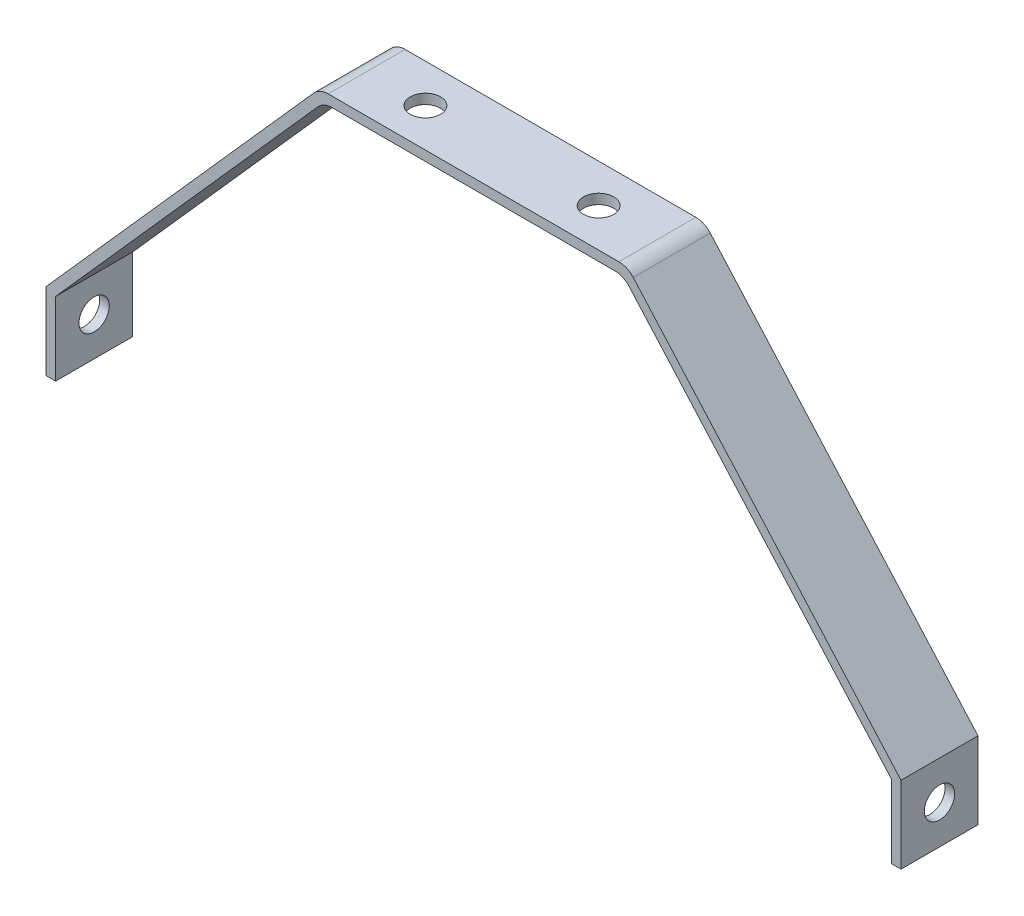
ISO-10303-21;
HEADER;
FILE_DESCRIPTION(('STEP AP214'),'2;1');
FILE_NAME('part.step','',(''),(''),'','','');
FILE_SCHEMA(('AUTOMOTIVE_DESIGN { 1 0 10303 214 1 1 1 1 }'));
ENDSEC;
DATA;
#1=APPLICATION_CONTEXT('core data for automotive mechanical design processes');
#2=APPLICATION_PROTOCOL_DEFINITION('international standard','automotive_design',2000,#1);
#3=PRODUCT_CONTEXT('',#1,'mechanical');
#4=PRODUCT('Part','Part','',(#3));
#5=PRODUCT_RELATED_PRODUCT_CATEGORY('part','',(#4));
#6=PRODUCT_DEFINITION_FORMATION('','',#4);
#7=PRODUCT_DEFINITION_CONTEXT('part definition',#1,'design');
#8=PRODUCT_DEFINITION('design','',#6,#7);
#9=PRODUCT_DEFINITION_SHAPE('','',#8);
#10=(LENGTH_UNIT() NAMED_UNIT(*) SI_UNIT(.MILLI.,.METRE.));
#11=(NAMED_UNIT(*) PLANE_ANGLE_UNIT() SI_UNIT($,.RADIAN.));
#12=(NAMED_UNIT(*) SI_UNIT($,.STERADIAN.) SOLID_ANGLE_UNIT());
#13=UNCERTAINTY_MEASURE_WITH_UNIT(LENGTH_MEASURE(1.E-05),#10,'distance_accuracy_value','');
#14=(GEOMETRIC_REPRESENTATION_CONTEXT(3) GLOBAL_UNCERTAINTY_ASSIGNED_CONTEXT((#13)) GLOBAL_UNIT_ASSIGNED_CONTEXT((#10,
#11,#12)) REPRESENTATION_CONTEXT('',''));
#15=CARTESIAN_POINT('',(0.,0.,0.));
#16=DIRECTION('',(0.,0.,1.));
#17=DIRECTION('',(1.,0.,0.));
#18=AXIS2_PLACEMENT_3D('',#15,#16,#17);
#19=CARTESIAN_POINT('',(141.008786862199,-19.7419871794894,25.4));
#20=DIRECTION('',(-1.,0.,0.));
#21=DIRECTION('',(0.,0.,1.));
#22=AXIS2_PLACEMENT_3D('',#19,#20,#21);
#23=PLANE('',#22);
#24=CARTESIAN_POINT('',(141.008786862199,-32.4419871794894,12.7));
#25=DIRECTION('',(-1.,0.,0.));
#26=DIRECTION('',(0.,0.,1.));
#27=AXIS2_PLACEMENT_3D('',#24,#25,#26);
#28=CIRCLE('',#27,5.);
#29=CARTESIAN_POINT('',(141.008786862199,-32.4419871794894,17.7));
#30=VERTEX_POINT('',#29);
#31=EDGE_CURVE('E206',#30,#30,#28,.T.);
#32=ORIENTED_EDGE('',*,*,#31,.T.);
#33=EDGE_LOOP('',(#32));
#34=FACE_BOUND('',#33,.T.);
#35=DIRECTION('',(0.,1.,0.));
#36=VECTOR('',#35,1.);
#37=CARTESIAN_POINT('',(141.008786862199,-19.7419871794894,0.));
#38=LINE('',#37,#36);
#39=CARTESIAN_POINT('',(141.008786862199,-45.1419871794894,0.));
#40=VERTEX_POINT('',#39);
#41=CARTESIAN_POINT('',(141.008786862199,-19.7419871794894,0.));
#42=VERTEX_POINT('',#41);
#43=EDGE_CURVE('E201',#40,#42,#38,.T.);
#44=ORIENTED_EDGE('',*,*,#43,.T.);
#45=DIRECTION('',(0.,0.,-1.));
#46=VECTOR('',#45,1.);
#47=CARTESIAN_POINT('',(141.008786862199,-19.7419871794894,25.4));
#48=LINE('',#47,#46);
#49=CARTESIAN_POINT('',(141.008786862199,-19.7419871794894,25.4));
#50=VERTEX_POINT('',#49);
#51=EDGE_CURVE('E11',#50,#42,#48,.T.);
#52=ORIENTED_EDGE('',*,*,#51,.F.);
#53=DIRECTION('',(0.,1.,0.));
#54=VECTOR('',#53,1.);
#55=CARTESIAN_POINT('',(141.008786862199,-19.7419871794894,25.4));
#56=LINE('',#55,#54);
#57=CARTESIAN_POINT('',(141.008786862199,-45.1419871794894,25.4));
#58=VERTEX_POINT('',#57);
#59=EDGE_CURVE('E248',#58,#50,#56,.T.);
#60=ORIENTED_EDGE('',*,*,#59,.F.);
#61=DIRECTION('',(0.,0.,-1.));
#62=VECTOR('',#61,1.);
#63=CARTESIAN_POINT('',(141.008786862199,-45.1419871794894,25.4));
#64=LINE('',#63,#62);
#65=EDGE_CURVE('E197',#58,#40,#64,.T.);
#66=ORIENTED_EDGE('',*,*,#65,.T.);
#67=EDGE_LOOP('',(#44,#52,#60,#66));
#68=FACE_BOUND('',#67,.T.);
#69=ADVANCED_FACE('F49',(#34,#68),#23,.F.);
#70=CARTESIAN_POINT('',(52.6947057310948,79.7240510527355,25.4));
#71=DIRECTION('',(-0.74778316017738,-0.663943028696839,0.));
#72=DIRECTION('',(0.663943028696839,-0.74778316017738,0.));
#73=AXIS2_PLACEMENT_3D('',#70,#71,#72);
#74=PLANE('',#73);
#75=DIRECTION('',(-0.663943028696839,0.74778316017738,0.));
#76=VECTOR('',#75,1.);
#77=CARTESIAN_POINT('',(52.6947057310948,79.7240510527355,0.));
#78=LINE('',#77,#76);
#79=CARTESIAN_POINT('',(52.6947057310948,79.7240510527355,0.));
#80=VERTEX_POINT('',#79);
#81=EDGE_CURVE('E205',#42,#80,#78,.T.);
#82=ORIENTED_EDGE('',*,*,#81,.T.);
#83=DIRECTION('',(0.,0.,-1.));
#84=VECTOR('',#83,1.);
#85=CARTESIAN_POINT('',(52.6947057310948,79.7240510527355,25.4));
#86=LINE('',#85,#84);
#87=CARTESIAN_POINT('',(52.6947057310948,79.7240510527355,25.4));
#88=VERTEX_POINT('',#87);
#89=EDGE_CURVE('E59',#88,#80,#86,.T.);
#90=ORIENTED_EDGE('',*,*,#89,.F.);
#91=DIRECTION('',(-0.663943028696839,0.74778316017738,0.));
#92=VECTOR('',#91,1.);
#93=CARTESIAN_POINT('',(52.6947057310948,79.7240510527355,25.4));
#94=LINE('',#93,#92);
#95=EDGE_CURVE('E135',#50,#88,#94,.T.);
#96=ORIENTED_EDGE('',*,*,#95,.F.);
#97=ORIENTED_EDGE('',*,*,#51,.T.);
#98=EDGE_LOOP('',(#82,#90,#96,#97));
#99=FACE_BOUND('',#98,.T.);
#100=ADVANCED_FACE('F432',(#99),#74,.F.);
#101=CARTESIAN_POINT('',(47.9462826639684,75.5080128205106,25.4));
#102=DIRECTION('',(0.,0.,-1.));
#103=DIRECTION('',(-1.,0.,0.));
#104=AXIS2_PLACEMENT_3D('',#101,#102,#103);
#105=CYLINDRICAL_SURFACE('',#104,6.34999999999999);
#106=CARTESIAN_POINT('',(47.9462826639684,75.5080128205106,0.));
#107=DIRECTION('',(0.,0.,1.));
#108=DIRECTION('',(1.,0.,0.));
#109=AXIS2_PLACEMENT_3D('',#106,#107,#108);
#110=CIRCLE('',#109,6.34999999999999);
#111=CARTESIAN_POINT('',(47.9462826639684,81.8580128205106,0.));
#112=VERTEX_POINT('',#111);
#113=EDGE_CURVE('E209',#80,#112,#110,.T.);
#114=ORIENTED_EDGE('',*,*,#113,.T.);
#115=DIRECTION('',(0.,0.,-1.));
#116=VECTOR('',#115,1.);
#117=CARTESIAN_POINT('',(47.9462826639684,81.8580128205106,25.4));
#118=LINE('',#117,#116);
#119=CARTESIAN_POINT('',(47.9462826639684,81.8580128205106,25.4));
#120=VERTEX_POINT('',#119);
#121=EDGE_CURVE('E291',#120,#112,#118,.T.);
#122=ORIENTED_EDGE('',*,*,#121,.F.);
#123=CARTESIAN_POINT('',(47.9462826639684,75.5080128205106,25.4));
#124=DIRECTION('',(0.,0.,1.));
#125=DIRECTION('',(1.,0.,0.));
#126=AXIS2_PLACEMENT_3D('',#123,#124,#125);
#127=CIRCLE('',#126,6.34999999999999);
#128=EDGE_CURVE('E336',#88,#120,#127,.T.);
#129=ORIENTED_EDGE('',*,*,#128,.F.);
#130=ORIENTED_EDGE('',*,*,#89,.T.);
#131=EDGE_LOOP('',(#114,#122,#129,#130));
#132=FACE_BOUND('',#131,.T.);
#133=ADVANCED_FACE('F439',(#132),#105,.T.);
#134=CARTESIAN_POINT('',(47.9462826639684,81.8580128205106,25.4));
#135=DIRECTION('',(0.,-1.,0.));
#136=DIRECTION('',(0.,0.,-1.));
#137=AXIS2_PLACEMENT_3D('',#134,#135,#136);
#138=PLANE('',#137);
#139=CARTESIAN_POINT('',(-28.575,81.8580128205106,12.7));
#140=DIRECTION('',(0.,-1.,0.));
#141=DIRECTION('',(0.,0.,-1.));
#142=AXIS2_PLACEMENT_3D('',#139,#140,#141);
#143=CIRCLE('',#142,5.);
#144=CARTESIAN_POINT('',(-28.575,81.8580128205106,7.7));
#145=VERTEX_POINT('',#144);
#146=EDGE_CURVE('E318',#145,#145,#143,.T.);
#147=ORIENTED_EDGE('',*,*,#146,.T.);
#148=EDGE_LOOP('',(#147));
#149=FACE_BOUND('',#148,.T.);
#150=CARTESIAN_POINT('',(28.575,81.8580128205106,12.7));
#151=DIRECTION('',(0.,-1.,0.));
#152=DIRECTION('',(0.,0.,-1.));
#153=AXIS2_PLACEMENT_3D('',#150,#151,#152);
#154=CIRCLE('',#153,5.);
#155=CARTESIAN_POINT('',(28.575,81.8580128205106,7.7));
#156=VERTEX_POINT('',#155);
#157=EDGE_CURVE('E306',#156,#156,#154,.T.);
#158=ORIENTED_EDGE('',*,*,#157,.T.);
#159=EDGE_LOOP('',(#158));
#160=FACE_BOUND('',#159,.T.);
#161=DIRECTION('',(-1.,0.,0.));
#162=VECTOR('',#161,1.);
#163=CARTESIAN_POINT('',(47.9462826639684,81.8580128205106,0.));
#164=LINE('',#163,#162);
#165=CARTESIAN_POINT('',(-47.9462826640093,81.8580128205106,0.));
#166=VERTEX_POINT('',#165);
#167=EDGE_CURVE('E212',#112,#166,#164,.T.);
#168=ORIENTED_EDGE('',*,*,#167,.T.);
#169=DIRECTION('',(0.,0.,-1.));
#170=VECTOR('',#169,1.);
#171=CARTESIAN_POINT('',(-47.9462826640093,81.8580128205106,25.4));
#172=LINE('',#171,#170);
#173=CARTESIAN_POINT('',(-47.9462826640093,81.8580128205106,25.4));
#174=VERTEX_POINT('',#173);
#175=EDGE_CURVE('E287',#174,#166,#172,.T.);
#176=ORIENTED_EDGE('',*,*,#175,.F.);
#177=DIRECTION('',(-1.,0.,0.));
#178=VECTOR('',#177,1.);
#179=CARTESIAN_POINT('',(47.9462826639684,81.8580128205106,25.4));
#180=LINE('',#179,#178);
#181=EDGE_CURVE('E339',#120,#174,#180,.T.);
#182=ORIENTED_EDGE('',*,*,#181,.F.);
#183=ORIENTED_EDGE('',*,*,#121,.T.);
#184=EDGE_LOOP('',(#168,#176,#182,#183));
#185=FACE_BOUND('',#184,.T.);
#186=ADVANCED_FACE('F466',(#149,#160,#185),#138,.F.);
#187=CARTESIAN_POINT('',(-47.9462826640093,75.5080128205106,25.4));
#188=DIRECTION('',(0.,0.,-1.));
#189=DIRECTION('',(-1.,0.,0.));
#190=AXIS2_PLACEMENT_3D('',#187,#188,#189);
#191=CYLINDRICAL_SURFACE('',#190,6.35);
#192=CARTESIAN_POINT('',(-47.9462826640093,75.5080128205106,0.));
#193=DIRECTION('',(0.,0.,1.));
#194=DIRECTION('',(1.,0.,0.));
#195=AXIS2_PLACEMENT_3D('',#192,#193,#194);
#196=CIRCLE('',#195,6.35);
#197=CARTESIAN_POINT('',(-52.6947057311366,79.7240510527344,0.));
#198=VERTEX_POINT('',#197);
#199=EDGE_CURVE('E215',#166,#198,#196,.T.);
#200=ORIENTED_EDGE('',*,*,#199,.T.);
#201=DIRECTION('',(0.,0.,-1.));
#202=VECTOR('',#201,1.);
#203=CARTESIAN_POINT('',(-52.6947057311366,79.7240510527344,25.4));
#204=LINE('',#203,#202);
#205=CARTESIAN_POINT('',(-52.6947057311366,79.7240510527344,25.4));
#206=VERTEX_POINT('',#205);
#207=EDGE_CURVE('E283',#206,#198,#204,.T.);
#208=ORIENTED_EDGE('',*,*,#207,.F.);
#209=CARTESIAN_POINT('',(-47.9462826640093,75.5080128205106,25.4));
#210=DIRECTION('',(0.,0.,1.));
#211=DIRECTION('',(1.,0.,0.));
#212=AXIS2_PLACEMENT_3D('',#209,#210,#211);
#213=CIRCLE('',#212,6.35);
#214=EDGE_CURVE('E342',#174,#206,#213,.T.);
#215=ORIENTED_EDGE('',*,*,#214,.F.);
#216=ORIENTED_EDGE('',*,*,#175,.T.);
#217=EDGE_LOOP('',(#200,#208,#215,#216));
#218=FACE_BOUND('',#217,.T.);
#219=ADVANCED_FACE('F468',(#218),#191,.T.);
#220=CARTESIAN_POINT('',(-52.6947057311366,79.7240510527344,25.4));
#221=DIRECTION('',(0.747783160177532,-0.663943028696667,0.));
#222=DIRECTION('',(0.663943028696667,0.747783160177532,0.));
#223=AXIS2_PLACEMENT_3D('',#220,#221,#222);
#224=PLANE('',#223);
#225=DIRECTION('',(-0.663943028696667,-0.747783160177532,0.));
#226=VECTOR('',#225,1.);
#227=CARTESIAN_POINT('',(-52.6947057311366,79.7240510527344,0.));
#228=LINE('',#227,#226);
#229=CARTESIAN_POINT('',(-141.008786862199,-19.7419871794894,0.));
#230=VERTEX_POINT('',#229);
#231=EDGE_CURVE('E218',#198,#230,#228,.T.);
#232=ORIENTED_EDGE('',*,*,#231,.T.);
#233=DIRECTION('',(0.,0.,-1.));
#234=VECTOR('',#233,1.);
#235=CARTESIAN_POINT('',(-141.008786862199,-19.7419871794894,25.4));
#236=LINE('',#235,#234);
#237=CARTESIAN_POINT('',(-141.008786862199,-19.7419871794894,25.4));
#238=VERTEX_POINT('',#237);
#239=EDGE_CURVE('E279',#238,#230,#236,.T.);
#240=ORIENTED_EDGE('',*,*,#239,.F.);
#241=DIRECTION('',(-0.663943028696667,-0.747783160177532,0.));
#242=VECTOR('',#241,1.);
#243=CARTESIAN_POINT('',(-52.6947057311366,79.7240510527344,25.4));
#244=LINE('',#243,#242);
#245=EDGE_CURVE('E345',#206,#238,#244,.T.);
#246=ORIENTED_EDGE('',*,*,#245,.F.);
#247=ORIENTED_EDGE('',*,*,#207,.T.);
#248=EDGE_LOOP('',(#232,#240,#246,#247));
#249=FACE_BOUND('',#248,.T.);
#250=ADVANCED_FACE('F484',(#249),#224,.F.);
#251=CARTESIAN_POINT('',(-141.008786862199,-19.7419871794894,25.4));
#252=DIRECTION('',(1.,0.,0.));
#253=DIRECTION('',(0.,0.,-1.));
#254=AXIS2_PLACEMENT_3D('',#251,#252,#253);
#255=PLANE('',#254);
#256=CARTESIAN_POINT('',(-141.008786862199,-32.4419871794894,12.7));
#257=DIRECTION('',(1.,0.,0.));
#258=DIRECTION('',(0.,0.,-1.));
#259=AXIS2_PLACEMENT_3D('',#256,#257,#258);
#260=CIRCLE('',#259,5.);
#261=CARTESIAN_POINT('',(-141.008786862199,-32.4419871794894,7.7));
#262=VERTEX_POINT('',#261);
#263=EDGE_CURVE('E302',#262,#262,#260,.T.);
#264=ORIENTED_EDGE('',*,*,#263,.T.);
#265=EDGE_LOOP('',(#264));
#266=FACE_BOUND('',#265,.T.);
#267=DIRECTION('',(0.,-1.,0.));
#268=VECTOR('',#267,1.);
#269=CARTESIAN_POINT('',(-141.008786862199,-19.7419871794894,0.));
#270=LINE('',#269,#268);
#271=CARTESIAN_POINT('',(-141.008786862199,-45.1419871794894,0.));
#272=VERTEX_POINT('',#271);
#273=EDGE_CURVE('E221',#230,#272,#270,.T.);
#274=ORIENTED_EDGE('',*,*,#273,.T.);
#275=DIRECTION('',(0.,0.,-1.));
#276=VECTOR('',#275,1.);
#277=CARTESIAN_POINT('',(-141.008786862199,-45.1419871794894,25.4));
#278=LINE('',#277,#276);
#279=CARTESIAN_POINT('',(-141.008786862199,-45.1419871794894,25.4));
#280=VERTEX_POINT('',#279);
#281=EDGE_CURVE('E275',#280,#272,#278,.T.);
#282=ORIENTED_EDGE('',*,*,#281,.F.);
#283=DIRECTION('',(0.,-1.,0.));
#284=VECTOR('',#283,1.);
#285=CARTESIAN_POINT('',(-141.008786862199,-19.7419871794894,25.4));
#286=LINE('',#285,#284);
#287=EDGE_CURVE('E348',#238,#280,#286,.T.);
#288=ORIENTED_EDGE('',*,*,#287,.F.);
#289=ORIENTED_EDGE('',*,*,#239,.T.);
#290=EDGE_LOOP('',(#274,#282,#288,#289));
#291=FACE_BOUND('',#290,.T.);
#292=ADVANCED_FACE('F488',(#266,#291),#255,.F.);
#293=CARTESIAN_POINT('',(-141.008786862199,-45.1419871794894,25.4));
#294=DIRECTION('',(0.,1.,0.));
#295=DIRECTION('',(0.,0.,1.));
#296=AXIS2_PLACEMENT_3D('',#293,#294,#295);
#297=PLANE('',#296);
#298=DIRECTION('',(1.,0.,0.));
#299=VECTOR('',#298,1.);
#300=CARTESIAN_POINT('',(-141.008786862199,-45.1419871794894,0.));
#301=LINE('',#300,#299);
#302=CARTESIAN_POINT('',(-137.833786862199,-45.1419871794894,0.));
#303=VERTEX_POINT('',#302);
#304=EDGE_CURVE('E224',#272,#303,#301,.T.);
#305=ORIENTED_EDGE('',*,*,#304,.T.);
#306=DIRECTION('',(0.,0.,-1.));
#307=VECTOR('',#306,1.);
#308=CARTESIAN_POINT('',(-137.833786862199,-45.1419871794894,25.4));
#309=LINE('',#308,#307);
#310=CARTESIAN_POINT('',(-137.833786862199,-45.1419871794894,25.4));
#311=VERTEX_POINT('',#310);
#312=EDGE_CURVE('E271',#311,#303,#309,.T.);
#313=ORIENTED_EDGE('',*,*,#312,.F.);
#314=DIRECTION('',(1.,0.,0.));
#315=VECTOR('',#314,1.);
#316=CARTESIAN_POINT('',(-141.008786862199,-45.1419871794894,25.4));
#317=LINE('',#316,#315);
#318=EDGE_CURVE('E351',#280,#311,#317,.T.);
#319=ORIENTED_EDGE('',*,*,#318,.F.);
#320=ORIENTED_EDGE('',*,*,#281,.T.);
#321=EDGE_LOOP('',(#305,#313,#319,#320));
#322=FACE_BOUND('',#321,.T.);
#323=ADVANCED_FACE('F504',(#322),#297,.F.);
#324=CARTESIAN_POINT('',(-137.833786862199,-45.1419871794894,25.4));
#325=DIRECTION('',(-1.,0.,0.));
#326=DIRECTION('',(0.,0.,1.));
#327=AXIS2_PLACEMENT_3D('',#324,#325,#326);
#328=PLANE('',#327);
#329=CARTESIAN_POINT('',(-137.833786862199,-32.4419871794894,12.7));
#330=DIRECTION('',(-1.,0.,0.));
#331=DIRECTION('',(0.,0.,1.));
#332=AXIS2_PLACEMENT_3D('',#329,#330,#331);
#333=CIRCLE('',#332,5.);
#334=CARTESIAN_POINT('',(-137.833786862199,-32.4419871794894,17.7));
#335=VERTEX_POINT('',#334);
#336=EDGE_CURVE('E301',#335,#335,#333,.T.);
#337=ORIENTED_EDGE('',*,*,#336,.T.);
#338=EDGE_LOOP('',(#337));
#339=FACE_BOUND('',#338,.T.);
#340=DIRECTION('',(0.,1.,0.));
#341=VECTOR('',#340,1.);
#342=CARTESIAN_POINT('',(-137.833786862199,-45.1419871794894,0.));
#343=LINE('',#342,#341);
#344=CARTESIAN_POINT('',(-137.833786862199,-20.9480973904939,0.));
#345=VERTEX_POINT('',#344);
#346=EDGE_CURVE('E227',#303,#345,#343,.T.);
#347=ORIENTED_EDGE('',*,*,#346,.T.);
#348=DIRECTION('',(0.,0.,-1.));
#349=VECTOR('',#348,1.);
#350=CARTESIAN_POINT('',(-137.833786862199,-20.9480973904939,25.4));
#351=LINE('',#350,#349);
#352=CARTESIAN_POINT('',(-137.833786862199,-20.9480973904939,25.4));
#353=VERTEX_POINT('',#352);
#354=EDGE_CURVE('E267',#353,#345,#351,.T.);
#355=ORIENTED_EDGE('',*,*,#354,.F.);
#356=DIRECTION('',(0.,1.,0.));
#357=VECTOR('',#356,1.);
#358=CARTESIAN_POINT('',(-137.833786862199,-45.1419871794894,25.4));
#359=LINE('',#358,#357);
#360=EDGE_CURVE('E354',#311,#353,#359,.T.);
#361=ORIENTED_EDGE('',*,*,#360,.F.);
#362=ORIENTED_EDGE('',*,*,#312,.T.);
#363=EDGE_LOOP('',(#347,#355,#361,#362));
#364=FACE_BOUND('',#363,.T.);
#365=ADVANCED_FACE('F508',(#339,#364),#328,.F.);
#366=CARTESIAN_POINT('',(-51.3478604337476,76.4589339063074,25.4));
#367=DIRECTION('',(-0.747783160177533,0.663943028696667,0.));
#368=DIRECTION('',(-0.663943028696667,-0.747783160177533,0.));
#369=AXIS2_PLACEMENT_3D('',#366,#367,#368);
#370=PLANE('',#369);
#371=DIRECTION('',(0.663943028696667,0.747783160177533,0.));
#372=VECTOR('',#371,1.);
#373=CARTESIAN_POINT('',(-51.3478604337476,76.4589339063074,0.));
#374=LINE('',#373,#372);
#375=CARTESIAN_POINT('',(-51.3478604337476,76.4589339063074,0.));
#376=VERTEX_POINT('',#375);
#377=EDGE_CURVE('E230',#345,#376,#374,.T.);
#378=ORIENTED_EDGE('',*,*,#377,.T.);
#379=DIRECTION('',(0.,0.,-1.));
#380=VECTOR('',#379,1.);
#381=CARTESIAN_POINT('',(-51.3478604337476,76.4589339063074,25.4));
#382=LINE('',#381,#380);
#383=CARTESIAN_POINT('',(-51.3478604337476,76.4589339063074,25.4));
#384=VERTEX_POINT('',#383);
#385=EDGE_CURVE('E263',#384,#376,#382,.T.);
#386=ORIENTED_EDGE('',*,*,#385,.F.);
#387=DIRECTION('',(0.663943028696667,0.747783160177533,0.));
#388=VECTOR('',#387,1.);
#389=CARTESIAN_POINT('',(-51.3478604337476,76.4589339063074,25.4));
#390=LINE('',#389,#388);
#391=EDGE_CURVE('E357',#353,#384,#390,.T.);
#392=ORIENTED_EDGE('',*,*,#391,.F.);
#393=ORIENTED_EDGE('',*,*,#354,.T.);
#394=EDGE_LOOP('',(#378,#386,#392,#393));
#395=FACE_BOUND('',#394,.T.);
#396=ADVANCED_FACE('F512',(#395),#370,.F.);
#397=CARTESIAN_POINT('',(-46.5994373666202,72.2428956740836,25.4));
#398=DIRECTION('',(0.,0.,-1.));
#399=DIRECTION('',(-1.,0.,0.));
#400=AXIS2_PLACEMENT_3D('',#397,#398,#399);
#401=CYLINDRICAL_SURFACE('',#400,6.34999999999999);
#402=CARTESIAN_POINT('',(-46.5994373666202,72.2428956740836,0.));
#403=DIRECTION('',(0.,0.,-1.));
#404=DIRECTION('',(1.,0.,0.));
#405=AXIS2_PLACEMENT_3D('',#402,#403,#404);
#406=CIRCLE('',#405,6.34999999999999);
#407=CARTESIAN_POINT('',(-46.5994373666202,78.5928956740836,0.));
#408=VERTEX_POINT('',#407);
#409=EDGE_CURVE('E233',#376,#408,#406,.T.);
#410=ORIENTED_EDGE('',*,*,#409,.T.);
#411=DIRECTION('',(0.,0.,-1.));
#412=VECTOR('',#411,1.);
#413=CARTESIAN_POINT('',(-46.5994373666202,78.5928956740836,25.4));
#414=LINE('',#413,#412);
#415=CARTESIAN_POINT('',(-46.5994373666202,78.5928956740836,25.4));
#416=VERTEX_POINT('',#415);
#417=EDGE_CURVE('E259',#416,#408,#414,.T.);
#418=ORIENTED_EDGE('',*,*,#417,.F.);
#419=CARTESIAN_POINT('',(-46.5994373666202,72.2428956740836,25.4));
#420=DIRECTION('',(0.,0.,-1.));
#421=DIRECTION('',(1.,0.,0.));
#422=AXIS2_PLACEMENT_3D('',#419,#420,#421);
#423=CIRCLE('',#422,6.34999999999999);
#424=EDGE_CURVE('E360',#384,#416,#423,.T.);
#425=ORIENTED_EDGE('',*,*,#424,.F.);
#426=ORIENTED_EDGE('',*,*,#385,.T.);
#427=EDGE_LOOP('',(#410,#418,#425,#426));
#428=FACE_BOUND('',#427,.T.);
#429=ADVANCED_FACE('F516',(#428),#401,.F.);
#430=CARTESIAN_POINT('',(46.5994373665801,78.5928956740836,25.4));
#431=DIRECTION('',(0.,1.,0.));
#432=DIRECTION('',(0.,0.,1.));
#433=AXIS2_PLACEMENT_3D('',#430,#431,#432);
#434=PLANE('',#433);
#435=CARTESIAN_POINT('',(-28.575,78.5928956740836,12.7));
#436=DIRECTION('',(0.,1.,0.));
#437=DIRECTION('',(0.,0.,1.));
#438=AXIS2_PLACEMENT_3D('',#435,#436,#437);
#439=CIRCLE('',#438,5.);
#440=CARTESIAN_POINT('',(-28.575,78.5928956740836,17.7));
#441=VERTEX_POINT('',#440);
#442=EDGE_CURVE('E52',#441,#441,#439,.T.);
#443=ORIENTED_EDGE('',*,*,#442,.T.);
#444=EDGE_LOOP('',(#443));
#445=FACE_BOUND('',#444,.T.);
#446=CARTESIAN_POINT('',(28.575,78.5928956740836,12.7));
#447=DIRECTION('',(0.,1.,0.));
#448=DIRECTION('',(0.,0.,1.));
#449=AXIS2_PLACEMENT_3D('',#446,#447,#448);
#450=CIRCLE('',#449,5.);
#451=CARTESIAN_POINT('',(28.575,78.5928956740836,17.7));
#452=VERTEX_POINT('',#451);
#453=EDGE_CURVE('E303',#452,#452,#450,.T.);
#454=ORIENTED_EDGE('',*,*,#453,.T.);
#455=EDGE_LOOP('',(#454));
#456=FACE_BOUND('',#455,.T.);
#457=DIRECTION('',(1.,0.,0.));
#458=VECTOR('',#457,1.);
#459=CARTESIAN_POINT('',(46.5994373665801,78.5928956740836,0.));
#460=LINE('',#459,#458);
#461=CARTESIAN_POINT('',(46.5994373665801,78.5928956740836,0.));
#462=VERTEX_POINT('',#461);
#463=EDGE_CURVE('E236',#408,#462,#460,.T.);
#464=ORIENTED_EDGE('',*,*,#463,.T.);
#465=DIRECTION('',(0.,0.,-1.));
#466=VECTOR('',#465,1.);
#467=CARTESIAN_POINT('',(46.5994373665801,78.5928956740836,25.4));
#468=LINE('',#467,#466);
#469=CARTESIAN_POINT('',(46.5994373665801,78.5928956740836,25.4));
#470=VERTEX_POINT('',#469);
#471=EDGE_CURVE('E255',#470,#462,#468,.T.);
#472=ORIENTED_EDGE('',*,*,#471,.F.);
#473=DIRECTION('',(1.,0.,0.));
#474=VECTOR('',#473,1.);
#475=CARTESIAN_POINT('',(46.5994373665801,78.5928956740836,25.4));
#476=LINE('',#475,#474);
#477=EDGE_CURVE('E363',#416,#470,#476,.T.);
#478=ORIENTED_EDGE('',*,*,#477,.F.);
#479=ORIENTED_EDGE('',*,*,#417,.T.);
#480=EDGE_LOOP('',(#464,#472,#478,#479));
#481=FACE_BOUND('',#480,.T.);
#482=ADVANCED_FACE('F407',(#445,#456,#481),#434,.F.);
#483=CARTESIAN_POINT('',(46.5994373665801,72.2428956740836,25.4));
#484=DIRECTION('',(0.,0.,-1.));
#485=DIRECTION('',(-1.,0.,0.));
#486=AXIS2_PLACEMENT_3D('',#483,#484,#485);
#487=CYLINDRICAL_SURFACE('',#486,6.34999999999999);
#488=CARTESIAN_POINT('',(46.5994373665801,72.2428956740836,0.));
#489=DIRECTION('',(0.,0.,-1.));
#490=DIRECTION('',(1.,0.,0.));
#491=AXIS2_PLACEMENT_3D('',#488,#489,#490);
#492=CIRCLE('',#491,6.34999999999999);
#493=CARTESIAN_POINT('',(51.3478604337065,76.4589339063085,0.));
#494=VERTEX_POINT('',#493);
#495=EDGE_CURVE('E239',#462,#494,#492,.T.);
#496=ORIENTED_EDGE('',*,*,#495,.T.);
#497=DIRECTION('',(0.,0.,-1.));
#498=VECTOR('',#497,1.);
#499=CARTESIAN_POINT('',(51.3478604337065,76.4589339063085,25.4));
#500=LINE('',#499,#498);
#501=CARTESIAN_POINT('',(51.3478604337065,76.4589339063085,25.4));
#502=VERTEX_POINT('',#501);
#503=EDGE_CURVE('E189',#502,#494,#500,.T.);
#504=ORIENTED_EDGE('',*,*,#503,.F.);
#505=CARTESIAN_POINT('',(46.5994373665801,72.2428956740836,25.4));
#506=DIRECTION('',(0.,0.,-1.));
#507=DIRECTION('',(1.,0.,0.));
#508=AXIS2_PLACEMENT_3D('',#505,#506,#507);
#509=CIRCLE('',#508,6.34999999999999);
#510=EDGE_CURVE('E178',#470,#502,#509,.T.);
#511=ORIENTED_EDGE('',*,*,#510,.F.);
#512=ORIENTED_EDGE('',*,*,#471,.T.);
#513=EDGE_LOOP('',(#496,#504,#511,#512));
#514=FACE_BOUND('',#513,.T.);
#515=ADVANCED_FACE('F411',(#514),#487,.F.);
#516=CARTESIAN_POINT('',(51.3478604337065,76.4589339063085,25.4));
#517=DIRECTION('',(0.74778316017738,0.663943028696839,0.));
#518=DIRECTION('',(-0.663943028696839,0.74778316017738,0.));
#519=AXIS2_PLACEMENT_3D('',#516,#517,#518);
#520=PLANE('',#519);
#521=DIRECTION('',(0.663943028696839,-0.74778316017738,0.));
#522=VECTOR('',#521,1.);
#523=CARTESIAN_POINT('',(51.3478604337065,76.4589339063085,0.));
#524=LINE('',#523,#522);
#525=CARTESIAN_POINT('',(137.833786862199,-20.9480973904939,0.));
#526=VERTEX_POINT('',#525);
#527=EDGE_CURVE('E187',#494,#526,#524,.T.);
#528=ORIENTED_EDGE('',*,*,#527,.T.);
#529=DIRECTION('',(0.,0.,-1.));
#530=VECTOR('',#529,1.);
#531=CARTESIAN_POINT('',(137.833786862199,-20.9480973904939,25.4));
#532=LINE('',#531,#530);
#533=CARTESIAN_POINT('',(137.833786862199,-20.9480973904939,25.4));
#534=VERTEX_POINT('',#533);
#535=EDGE_CURVE('E184',#534,#526,#532,.T.);
#536=ORIENTED_EDGE('',*,*,#535,.F.);
#537=DIRECTION('',(0.663943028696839,-0.74778316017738,0.));
#538=VECTOR('',#537,1.);
#539=CARTESIAN_POINT('',(51.3478604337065,76.4589339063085,25.4));
#540=LINE('',#539,#538);
#541=EDGE_CURVE('E172',#502,#534,#540,.T.);
#542=ORIENTED_EDGE('',*,*,#541,.F.);
#543=ORIENTED_EDGE('',*,*,#503,.T.);
#544=EDGE_LOOP('',(#528,#536,#542,#543));
#545=FACE_BOUND('',#544,.T.);
#546=ADVANCED_FACE('F185',(#545),#520,.F.);
#547=CARTESIAN_POINT('',(137.833786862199,-45.1419871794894,25.4));
#548=DIRECTION('',(1.,0.,0.));
#549=DIRECTION('',(0.,0.,-1.));
#550=AXIS2_PLACEMENT_3D('',#547,#548,#549);
#551=PLANE('',#550);
#552=CARTESIAN_POINT('',(137.833786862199,-32.4419871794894,12.7));
#553=DIRECTION('',(1.,0.,0.));
#554=DIRECTION('',(0.,0.,-1.));
#555=AXIS2_PLACEMENT_3D('',#552,#553,#554);
#556=CIRCLE('',#555,5.);
#557=CARTESIAN_POINT('',(137.833786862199,-32.4419871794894,7.7));
#558=VERTEX_POINT('',#557);
#559=EDGE_CURVE('E298',#558,#558,#556,.T.);
#560=ORIENTED_EDGE('',*,*,#559,.T.);
#561=EDGE_LOOP('',(#560));
#562=FACE_BOUND('',#561,.T.);
#563=DIRECTION('',(0.,-1.,0.));
#564=VECTOR('',#563,1.);
#565=CARTESIAN_POINT('',(137.833786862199,-45.1419871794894,0.));
#566=LINE('',#565,#564);
#567=CARTESIAN_POINT('',(137.833786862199,-45.1419871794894,0.));
#568=VERTEX_POINT('',#567);
#569=EDGE_CURVE('E121',#526,#568,#566,.T.);
#570=ORIENTED_EDGE('',*,*,#569,.T.);
#571=DIRECTION('',(0.,0.,-1.));
#572=VECTOR('',#571,1.);
#573=CARTESIAN_POINT('',(137.833786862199,-45.1419871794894,25.4));
#574=LINE('',#573,#572);
#575=CARTESIAN_POINT('',(137.833786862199,-45.1419871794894,25.4));
#576=VERTEX_POINT('',#575);
#577=EDGE_CURVE('E190',#576,#568,#574,.T.);
#578=ORIENTED_EDGE('',*,*,#577,.F.);
#579=DIRECTION('',(0.,-1.,0.));
#580=VECTOR('',#579,1.);
#581=CARTESIAN_POINT('',(137.833786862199,-45.1419871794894,25.4));
#582=LINE('',#581,#580);
#583=EDGE_CURVE('E176',#534,#576,#582,.T.);
#584=ORIENTED_EDGE('',*,*,#583,.F.);
#585=ORIENTED_EDGE('',*,*,#535,.T.);
#586=EDGE_LOOP('',(#570,#578,#584,#585));
#587=FACE_BOUND('',#586,.T.);
#588=ADVANCED_FACE('F192',(#562,#587),#551,.F.);
#589=CARTESIAN_POINT('',(141.008786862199,-45.1419871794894,25.4));
#590=DIRECTION('',(0.,1.,0.));
#591=DIRECTION('',(0.,0.,1.));
#592=AXIS2_PLACEMENT_3D('',#589,#590,#591);
#593=PLANE('',#592);
#594=DIRECTION('',(1.,0.,0.));
#595=VECTOR('',#594,1.);
#596=CARTESIAN_POINT('',(141.008786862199,-45.1419871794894,0.));
#597=LINE('',#596,#595);
#598=EDGE_CURVE('E127',#568,#40,#597,.T.);
#599=ORIENTED_EDGE('',*,*,#598,.T.);
#600=ORIENTED_EDGE('',*,*,#65,.F.);
#601=DIRECTION('',(1.,0.,0.));
#602=VECTOR('',#601,1.);
#603=CARTESIAN_POINT('',(141.008786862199,-45.1419871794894,25.4));
#604=LINE('',#603,#602);
#605=EDGE_CURVE('E68',#576,#58,#604,.T.);
#606=ORIENTED_EDGE('',*,*,#605,.F.);
#607=ORIENTED_EDGE('',*,*,#577,.T.);
#608=EDGE_LOOP('',(#599,#600,#606,#607));
#609=FACE_BOUND('',#608,.T.);
#610=ADVANCED_FACE('F419',(#609),#593,.F.);
#611=CARTESIAN_POINT('',(46.5994373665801,72.2428956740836,25.4));
#612=DIRECTION('',(0.,0.,1.));
#613=DIRECTION('',(1.,0.,0.));
#614=AXIS2_PLACEMENT_3D('',#611,#612,#613);
#615=PLANE('',#614);
#616=ORIENTED_EDGE('',*,*,#59,.T.);
#617=ORIENTED_EDGE('',*,*,#95,.T.);
#618=ORIENTED_EDGE('',*,*,#128,.T.);
#619=ORIENTED_EDGE('',*,*,#181,.T.);
#620=ORIENTED_EDGE('',*,*,#214,.T.);
#621=ORIENTED_EDGE('',*,*,#245,.T.);
#622=ORIENTED_EDGE('',*,*,#287,.T.);
#623=ORIENTED_EDGE('',*,*,#318,.T.);
#624=ORIENTED_EDGE('',*,*,#360,.T.);
#625=ORIENTED_EDGE('',*,*,#391,.T.);
#626=ORIENTED_EDGE('',*,*,#424,.T.);
#627=ORIENTED_EDGE('',*,*,#477,.T.);
#628=ORIENTED_EDGE('',*,*,#510,.T.);
#629=ORIENTED_EDGE('',*,*,#541,.T.);
#630=ORIENTED_EDGE('',*,*,#583,.T.);
#631=ORIENTED_EDGE('',*,*,#605,.T.);
#632=EDGE_LOOP('',(#616,#617,#618,#619,#620,#621,#622,#623,#624,#625,#626,#627,#628,#629,#630,#631));
#633=FACE_BOUND('',#632,.T.);
#634=ADVANCED_FACE('F174',(#633),#615,.T.);
#635=CARTESIAN_POINT('',(46.5994373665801,72.2428956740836,0.));
#636=DIRECTION('',(0.,0.,1.));
#637=DIRECTION('',(1.,0.,0.));
#638=AXIS2_PLACEMENT_3D('',#635,#636,#637);
#639=PLANE('',#638);
#640=ORIENTED_EDGE('',*,*,#43,.F.);
#641=ORIENTED_EDGE('',*,*,#598,.F.);
#642=ORIENTED_EDGE('',*,*,#569,.F.);
#643=ORIENTED_EDGE('',*,*,#527,.F.);
#644=ORIENTED_EDGE('',*,*,#495,.F.);
#645=ORIENTED_EDGE('',*,*,#463,.F.);
#646=ORIENTED_EDGE('',*,*,#409,.F.);
#647=ORIENTED_EDGE('',*,*,#377,.F.);
#648=ORIENTED_EDGE('',*,*,#346,.F.);
#649=ORIENTED_EDGE('',*,*,#304,.F.);
#650=ORIENTED_EDGE('',*,*,#273,.F.);
#651=ORIENTED_EDGE('',*,*,#231,.F.);
#652=ORIENTED_EDGE('',*,*,#199,.F.);
#653=ORIENTED_EDGE('',*,*,#167,.F.);
#654=ORIENTED_EDGE('',*,*,#113,.F.);
#655=ORIENTED_EDGE('',*,*,#81,.F.);
#656=EDGE_LOOP('',(#640,#641,#642,#643,#644,#645,#646,#647,#648,#649,#650,#651,#652,#653,#654,#655));
#657=FACE_BOUND('',#656,.T.);
#658=ADVANCED_FACE('F414',(#657),#639,.F.);
#659=CARTESIAN_POINT('',(-141.008786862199,-32.4419871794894,12.7));
#660=DIRECTION('',(1.,0.,0.));
#661=DIRECTION('',(0.,0.,-1.));
#662=AXIS2_PLACEMENT_3D('',#659,#660,#661);
#663=CYLINDRICAL_SURFACE('',#662,5.);
#664=ORIENTED_EDGE('',*,*,#559,.F.);
#665=EDGE_LOOP('',(#664));
#666=FACE_BOUND('',#665,.T.);
#667=ORIENTED_EDGE('',*,*,#31,.F.);
#668=EDGE_LOOP('',(#667));
#669=FACE_BOUND('',#668,.T.);
#670=ADVANCED_FACE('F442',(#666,#669),#663,.F.);
#671=ORIENTED_EDGE('',*,*,#263,.F.);
#672=EDGE_LOOP('',(#671));
#673=FACE_BOUND('',#672,.T.);
#674=ORIENTED_EDGE('',*,*,#336,.F.);
#675=EDGE_LOOP('',(#674));
#676=FACE_BOUND('',#675,.T.);
#677=ADVANCED_FACE('F444',(#673,#676),#663,.F.);
#678=CARTESIAN_POINT('',(28.575,-45.1419871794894,12.7));
#679=DIRECTION('',(0.,1.,0.));
#680=DIRECTION('',(0.,0.,1.));
#681=AXIS2_PLACEMENT_3D('',#678,#679,#680);
#682=CYLINDRICAL_SURFACE('',#681,5.);
#683=ORIENTED_EDGE('',*,*,#453,.F.);
#684=EDGE_LOOP('',(#683));
#685=FACE_BOUND('',#684,.T.);
#686=ORIENTED_EDGE('',*,*,#157,.F.);
#687=EDGE_LOOP('',(#686));
#688=FACE_BOUND('',#687,.T.);
#689=ADVANCED_FACE('F450',(#685,#688),#682,.F.);
#690=CARTESIAN_POINT('',(-28.575,-45.1419871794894,12.7));
#691=DIRECTION('',(0.,1.,0.));
#692=DIRECTION('',(0.,0.,1.));
#693=AXIS2_PLACEMENT_3D('',#690,#691,#692);
#694=CYLINDRICAL_SURFACE('',#693,5.);
#695=ORIENTED_EDGE('',*,*,#442,.F.);
#696=EDGE_LOOP('',(#695));
#697=FACE_BOUND('',#696,.T.);
#698=ORIENTED_EDGE('',*,*,#146,.F.);
#699=EDGE_LOOP('',(#698));
#700=FACE_BOUND('',#699,.T.);
#701=ADVANCED_FACE('F456',(#697,#700),#694,.F.);
#702=CLOSED_SHELL('',(#69,#100,#133,#186,#219,#250,#292,#323,#365,#396,#429,#482,#515,#546,#588,
#610,#634,#658,#670,#677,#689,#701));
#703=MANIFOLD_SOLID_BREP('B2',#702);
#704=ADVANCED_BREP_SHAPE_REPRESENTATION('',(#18,#703),#14);
#705=SHAPE_DEFINITION_REPRESENTATION(#9,#704);
ENDSEC;
END-ISO-10303-21;
